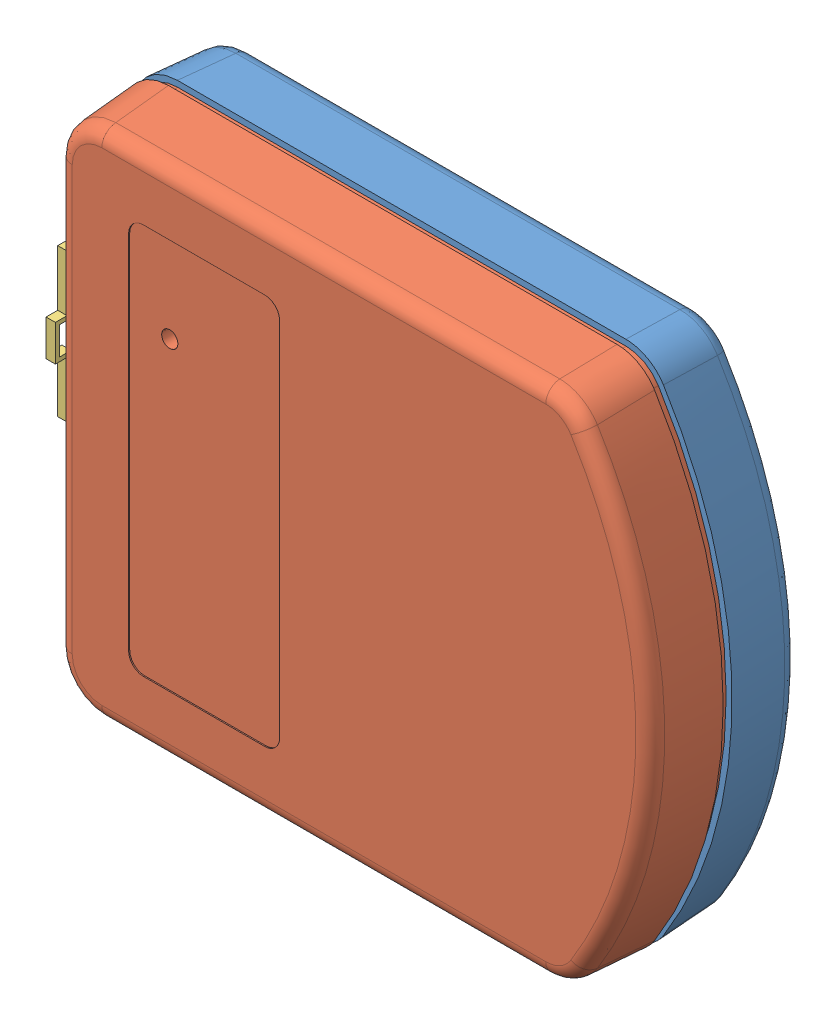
SolidWorks assembly Proto1.SLDASM, configuration Default (file format 6000). Lengths in mm.
Overall size (112.59 89.74 25.4).
3 component instances, 3 part files, 6 mates.
Components (placement in the parent):
- BottomP1-1: BottomP1.SLDPRT [Default] at (0.0083 9.662 66.44) size (102.74 89.74 11.94)
- TopP1-1: TopP1.SLDPRT [Default] at (0.0083 97.292 91.84) x (1 0 0) z (0 0 -1) size (102.74 89.74 19.05)
- conntemp-1: conntemp.SLDPRT [Default] at (0.7338 66.1676 76.84) x (0 -1 0) z (-1 0 0) size (25.4 6.6 11.2)
Mates (geometry in assembly coordinates):
- Coincident1: coincident anti-aligned: plane of BottomP1-1 through (10.3047 86.9956 72.79) normal (0 0 1); plane of TopP1-1 through (10.3047 19.9583 72.79) normal (0 0 -1)
- Concentric1: concentric anti-aligned: circle of BottomP1-1; circle of TopP1-1
- Concentric2: concentric anti-aligned: circle of BottomP1-1; circle of TopP1-1
- Distance4: distance = 10.4662 mm anti-aligned: plane of conntemp-1 through (-10.4662 66.1676 76.84) normal (-1 0 0); plane of assembly through (0 0 0) normal (1 0 0)
- Coincident7: coincident: line of TopP1-1 through (-0.5367 40.7676 81.44) axis (-0.052336 0 -0.99863); plane of conntemp-1 through (-10.4662 40.7676 76.84) normal (0 -1 0)
- Coincident8: coincident anti-aligned: plane of BottomP1-1 through (-5.0717 66.1676 76.84) normal (0 0 1); plane of conntemp-1 through (-10.4662 66.1676 76.84) normal (0 0 -1)
